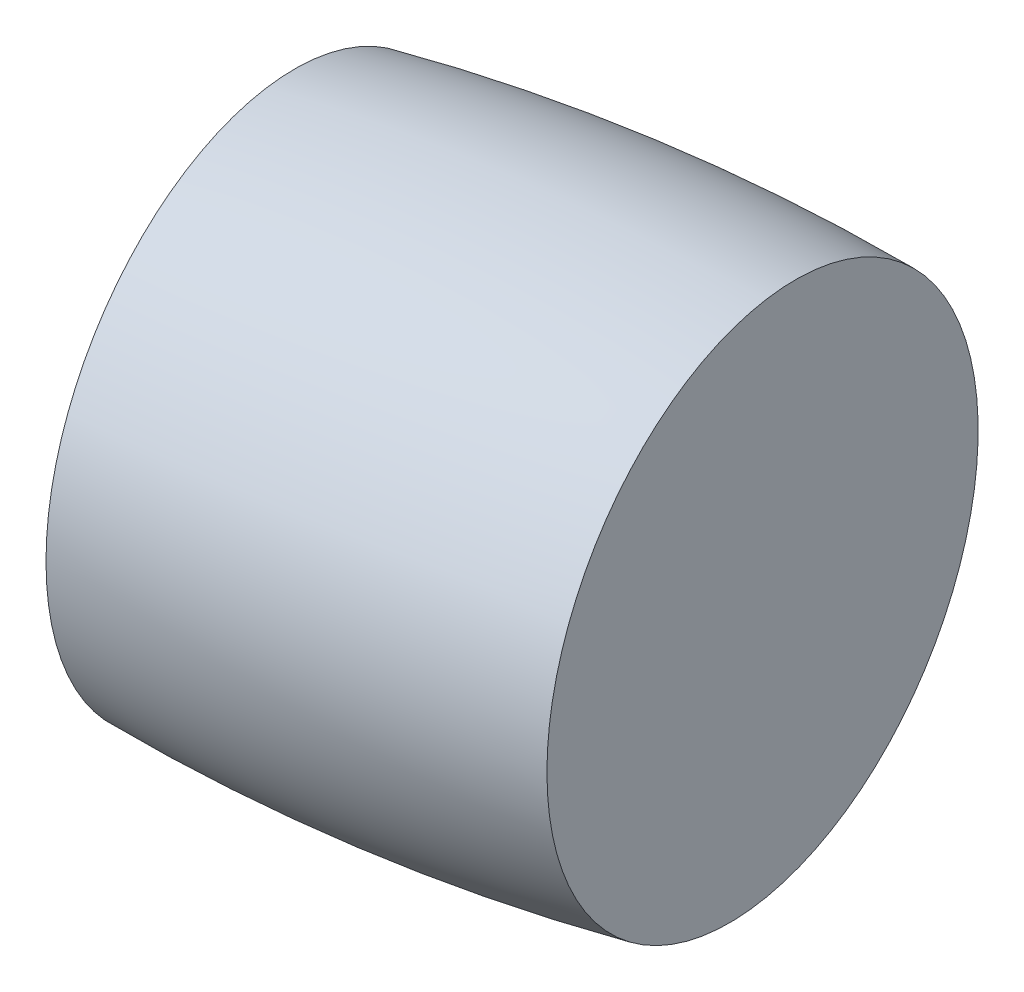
ISO-10303-21;
HEADER;
FILE_DESCRIPTION(('STEP AP214'),'2;1');
FILE_NAME('part.step','',(''),(''),'','','');
FILE_SCHEMA(('AUTOMOTIVE_DESIGN { 1 0 10303 214 1 1 1 1 }'));
ENDSEC;
DATA;
#1=APPLICATION_CONTEXT('core data for automotive mechanical design processes');
#2=APPLICATION_PROTOCOL_DEFINITION('international standard','automotive_design',2000,#1);
#3=PRODUCT_CONTEXT('',#1,'mechanical');
#4=PRODUCT('Part','Part','',(#3));
#5=PRODUCT_RELATED_PRODUCT_CATEGORY('part','',(#4));
#6=PRODUCT_DEFINITION_FORMATION('','',#4);
#7=PRODUCT_DEFINITION_CONTEXT('part definition',#1,'design');
#8=PRODUCT_DEFINITION('design','',#6,#7);
#9=PRODUCT_DEFINITION_SHAPE('','',#8);
#10=(LENGTH_UNIT() NAMED_UNIT(*) SI_UNIT(.MILLI.,.METRE.));
#11=(NAMED_UNIT(*) PLANE_ANGLE_UNIT() SI_UNIT($,.RADIAN.));
#12=(NAMED_UNIT(*) SI_UNIT($,.STERADIAN.) SOLID_ANGLE_UNIT());
#13=UNCERTAINTY_MEASURE_WITH_UNIT(LENGTH_MEASURE(1.E-05),#10,'distance_accuracy_value','');
#14=(GEOMETRIC_REPRESENTATION_CONTEXT(3) GLOBAL_UNCERTAINTY_ASSIGNED_CONTEXT((#13)) GLOBAL_UNIT_ASSIGNED_CONTEXT((#10,
#11,#12)) REPRESENTATION_CONTEXT('',''));
#15=CARTESIAN_POINT('',(0.,0.,0.));
#16=DIRECTION('',(0.,0.,1.));
#17=DIRECTION('',(1.,0.,0.));
#18=AXIS2_PLACEMENT_3D('',#15,#16,#17);
#19=CARTESIAN_POINT('',(0.,0.,0.));
#20=DIRECTION('',(-0.987879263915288,0.,0.155224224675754));
#21=DIRECTION('',(0.155224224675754,0.,0.987879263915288));
#22=AXIS2_PLACEMENT_3D('',#19,#20,#21);
#23=DEGENERATE_TOROIDAL_SURFACE('',#22,64.4229341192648,75.,.F.);
#24=CARTESIAN_POINT('',(-8.43385360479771,0.,1.32520079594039));
#25=DIRECTION('',(-0.987879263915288,0.,0.155224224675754));
#26=DIRECTION('',(0.155224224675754,0.,0.987879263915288));
#27=AXIS2_PLACEMENT_3D('',#24,#25,#26);
#28=CIRCLE('',#27,10.089574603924);
#29=CARTESIAN_POINT('',(-6.86770720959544,0.,11.2924823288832));
#30=VERTEX_POINT('',#29);
#31=EDGE_CURVE('E10',#30,#30,#28,.T.);
#32=ORIENTED_EDGE('',*,*,#31,.F.);
#33=EDGE_LOOP('',(#32));
#34=FACE_BOUND('',#33,.T.);
#35=CARTESIAN_POINT('',(8.43385360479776,0.,-1.32520079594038));
#36=DIRECTION('',(-0.987879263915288,0.,0.155224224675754));
#37=DIRECTION('',(0.155224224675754,0.,0.987879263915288));
#38=AXIS2_PLACEMENT_3D('',#35,#36,#37);
#39=CIRCLE('',#38,10.089574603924);
#40=CARTESIAN_POINT('',(10.,0.,8.6420807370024));
#41=VERTEX_POINT('',#40);
#42=EDGE_CURVE('E35',#41,#41,#39,.T.);
#43=ORIENTED_EDGE('',*,*,#42,.T.);
#44=EDGE_LOOP('',(#43));
#45=FACE_BOUND('',#44,.T.);
#46=ADVANCED_FACE('F29',(#34,#45),#23,.F.);
#47=CARTESIAN_POINT('',(-8.43385360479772,0.,1.32520079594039));
#48=DIRECTION('',(0.987879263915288,0.,-0.155224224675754));
#49=DIRECTION('',(-0.155224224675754,0.,-0.987879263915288));
#50=AXIS2_PLACEMENT_3D('',#47,#48,#49);
#51=PLANE('',#50);
#52=ORIENTED_EDGE('',*,*,#31,.T.);
#53=EDGE_LOOP('',(#52));
#54=FACE_BOUND('',#53,.T.);
#55=ADVANCED_FACE('F44',(#54),#51,.F.);
#56=CARTESIAN_POINT('',(8.43385360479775,0.,-1.32520079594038));
#57=DIRECTION('',(-0.987879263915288,0.,0.155224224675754));
#58=DIRECTION('',(0.155224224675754,0.,0.987879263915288));
#59=AXIS2_PLACEMENT_3D('',#56,#57,#58);
#60=PLANE('',#59);
#61=ORIENTED_EDGE('',*,*,#42,.F.);
#62=EDGE_LOOP('',(#61));
#63=FACE_BOUND('',#62,.T.);
#64=ADVANCED_FACE('F42',(#63),#60,.F.);
#65=CLOSED_SHELL('',(#46,#55,#64));
#66=MANIFOLD_SOLID_BREP('B2',#65);
#67=ADVANCED_BREP_SHAPE_REPRESENTATION('',(#18,#66),#14);
#68=SHAPE_DEFINITION_REPRESENTATION(#9,#67);
ENDSEC;
END-ISO-10303-21;
